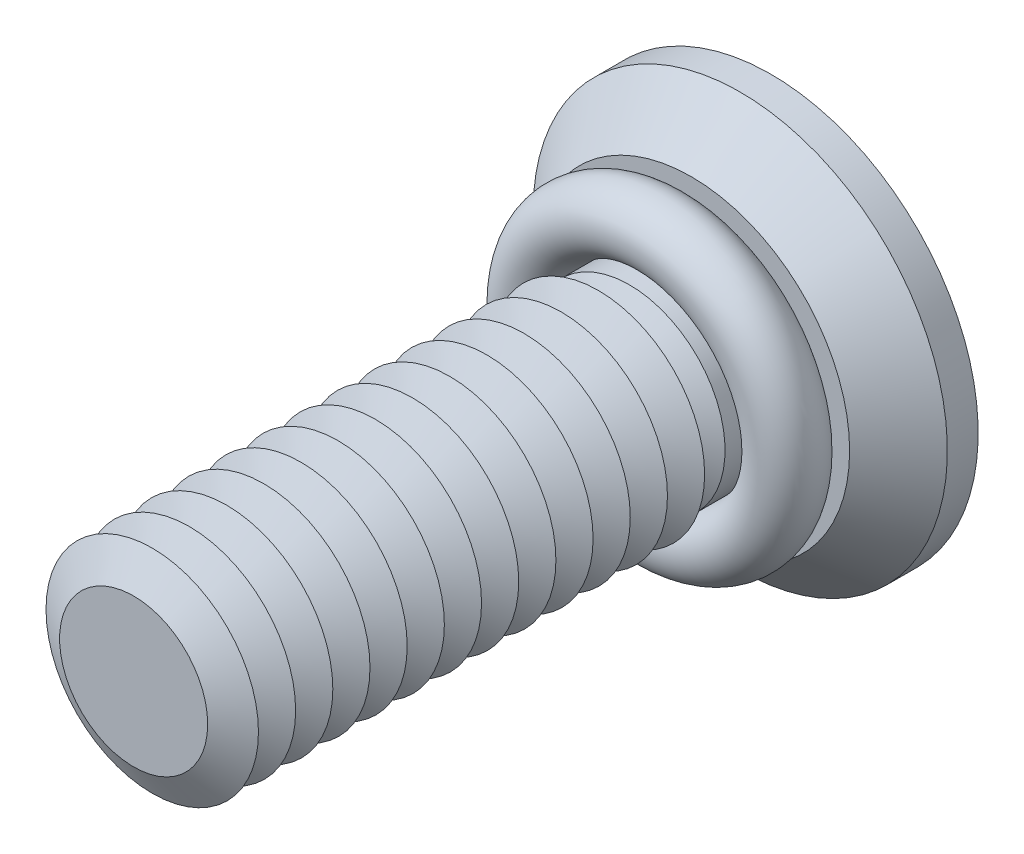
ISO-10303-21;
HEADER;
FILE_DESCRIPTION(('STEP AP214'),'2;1');
FILE_NAME('part.step','',(''),(''),'','','');
FILE_SCHEMA(('AUTOMOTIVE_DESIGN { 1 0 10303 214 1 1 1 1 }'));
ENDSEC;
DATA;
#1=APPLICATION_CONTEXT('core data for automotive mechanical design processes');
#2=APPLICATION_PROTOCOL_DEFINITION('international standard','automotive_design',2000,#1);
#3=PRODUCT_CONTEXT('',#1,'mechanical');
#4=PRODUCT('Part','Part','',(#3));
#5=PRODUCT_RELATED_PRODUCT_CATEGORY('part','',(#4));
#6=PRODUCT_DEFINITION_FORMATION('','',#4);
#7=PRODUCT_DEFINITION_CONTEXT('part definition',#1,'design');
#8=PRODUCT_DEFINITION('design','',#6,#7);
#9=PRODUCT_DEFINITION_SHAPE('','',#8);
#10=(LENGTH_UNIT() NAMED_UNIT(*) SI_UNIT(.MILLI.,.METRE.));
#11=(NAMED_UNIT(*) PLANE_ANGLE_UNIT() SI_UNIT($,.RADIAN.));
#12=(NAMED_UNIT(*) SI_UNIT($,.STERADIAN.) SOLID_ANGLE_UNIT());
#13=UNCERTAINTY_MEASURE_WITH_UNIT(LENGTH_MEASURE(1.E-05),#10,'distance_accuracy_value','');
#14=(GEOMETRIC_REPRESENTATION_CONTEXT(3) GLOBAL_UNCERTAINTY_ASSIGNED_CONTEXT((#13)) GLOBAL_UNIT_ASSIGNED_CONTEXT((#10,
#11,#12)) REPRESENTATION_CONTEXT('',''));
#15=CARTESIAN_POINT('',(0.,0.,0.));
#16=DIRECTION('',(0.,0.,1.));
#17=DIRECTION('',(1.,0.,0.));
#18=AXIS2_PLACEMENT_3D('',#15,#16,#17);
#19=CARTESIAN_POINT('',(0.,0.,2.1));
#20=DIRECTION('',(0.,0.,1.));
#21=DIRECTION('',(1.,0.,0.));
#22=AXIS2_PLACEMENT_3D('',#19,#20,#21);
#23=TOROIDAL_SURFACE('',#22,2.4,0.6);
#24=CARTESIAN_POINT('',(0.,2.4,2.1));
#25=DIRECTION('',(1.,0.,0.));
#26=DIRECTION('',(0.,0.,-1.));
#27=AXIS2_PLACEMENT_3D('',#24,#25,#26);
#28=CIRCLE('',#27,0.6);
#29=CARTESIAN_POINT('',(0.,3.,2.1));
#30=VERTEX_POINT('',#29);
#31=EDGE_CURVE('P0_E10',#30,#30,#28,.T.);
#32=CARTESIAN_POINT('',(0.,0.,2.1));
#33=DIRECTION('',(0.,0.,1.));
#34=DIRECTION('',(1.,0.,0.));
#35=AXIS2_PLACEMENT_3D('',#32,#33,#34);
#36=CIRCLE('',#35,3.);
#37=EDGE_CURVE('',#30,#30,#36,.T.);
#38=ORIENTED_EDGE('',*,*,#31,.F.);
#39=ORIENTED_EDGE('',*,*,#31,.T.);
#40=ORIENTED_EDGE('',*,*,#37,.T.);
#41=ORIENTED_EDGE('',*,*,#37,.F.);
#42=EDGE_LOOP('',(#38,#40,#39,#41));
#43=FACE_BOUND('',#42,.T.);
#44=ADVANCED_FACE('P0_F14',(#43),#23,.T.);
#45=CLOSED_SHELL('',(#44));
#46=MANIFOLD_SOLID_BREP('P0_B1',#45);
#47=CARTESIAN_POINT('',(0.,0.,8.5));
#48=DIRECTION('',(0.,0.,-1.));
#49=DIRECTION('',(-1.,0.,0.));
#50=AXIS2_PLACEMENT_3D('',#47,#48,#49);
#51=CONICAL_SURFACE('',#50,1.39378221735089,1.0471975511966);
#52=CARTESIAN_POINT('',(0.,0.,8.15));
#53=DIRECTION('',(0.,0.,1.));
#54=DIRECTION('',(1.,0.,0.));
#55=AXIS2_PLACEMENT_3D('',#52,#53,#54);
#56=CIRCLE('',#55,2.);
#57=CARTESIAN_POINT('',(2.,0.,8.15));
#58=VERTEX_POINT('',#57);
#59=EDGE_CURVE('P1_E324',#58,#58,#56,.T.);
#60=ORIENTED_EDGE('',*,*,#59,.T.);
#61=EDGE_LOOP('',(#60));
#62=FACE_BOUND('',#61,.T.);
#63=CARTESIAN_POINT('',(0.,0.,8.5));
#64=DIRECTION('',(0.,0.,1.));
#65=DIRECTION('',(1.,0.,0.));
#66=AXIS2_PLACEMENT_3D('',#63,#64,#65);
#67=CIRCLE('',#66,1.39378221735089);
#68=CARTESIAN_POINT('',(1.39378221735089,0.,8.5));
#69=VERTEX_POINT('',#68);
#70=EDGE_CURVE('P1_E321',#69,#69,#67,.T.);
#71=ORIENTED_EDGE('',*,*,#70,.F.);
#72=EDGE_LOOP('',(#71));
#73=FACE_BOUND('',#72,.T.);
#74=ADVANCED_FACE('P1_F15',(#62,#73),#51,.T.);
#75=CARTESIAN_POINT('',(0.,0.,8.85));
#76=DIRECTION('',(0.,0.,1.));
#77=DIRECTION('',(1.,0.,0.));
#78=AXIS2_PLACEMENT_3D('',#75,#76,#77);
#79=CONICAL_SURFACE('',#78,2.,1.0471975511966);
#80=ORIENTED_EDGE('',*,*,#70,.T.);
#81=EDGE_LOOP('',(#80));
#82=FACE_BOUND('',#81,.T.);
#83=CARTESIAN_POINT('',(0.,0.,8.85));
#84=DIRECTION('',(0.,0.,1.));
#85=DIRECTION('',(1.,0.,0.));
#86=AXIS2_PLACEMENT_3D('',#83,#84,#85);
#87=CIRCLE('',#86,2.);
#88=CARTESIAN_POINT('',(2.,0.,8.85));
#89=VERTEX_POINT('',#88);
#90=EDGE_CURVE('P1_E318',#89,#89,#87,.T.);
#91=ORIENTED_EDGE('',*,*,#90,.F.);
#92=EDGE_LOOP('',(#91));
#93=FACE_BOUND('',#92,.T.);
#94=ADVANCED_FACE('P1_F245',(#82,#93),#79,.T.);
#95=CARTESIAN_POINT('',(0.,0.,12.));
#96=DIRECTION('',(0.,0.,1.));
#97=DIRECTION('',(1.,0.,0.));
#98=AXIS2_PLACEMENT_3D('',#95,#96,#97);
#99=PLANE('',#98);
#100=CARTESIAN_POINT('',(0.,0.,12.));
#101=DIRECTION('',(0.,0.,1.));
#102=DIRECTION('',(1.,0.,0.));
#103=AXIS2_PLACEMENT_3D('',#100,#101,#102);
#104=CIRCLE('',#103,1.39378221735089);
#105=CARTESIAN_POINT('',(1.39378221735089,0.,12.));
#106=VERTEX_POINT('',#105);
#107=EDGE_CURVE('P1_E131',#106,#106,#104,.T.);
#108=ORIENTED_EDGE('',*,*,#107,.T.);
#109=EDGE_LOOP('',(#108));
#110=FACE_BOUND('',#109,.T.);
#111=ADVANCED_FACE('P1_F251',(#110),#99,.T.);
#112=CARTESIAN_POINT('',(0.,0.,12.));
#113=DIRECTION('',(0.,0.,-1.));
#114=DIRECTION('',(-1.,0.,0.));
#115=AXIS2_PLACEMENT_3D('',#112,#113,#114);
#116=CONICAL_SURFACE('',#115,1.39378221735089,1.0471975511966);
#117=CARTESIAN_POINT('',(0.,0.,11.65));
#118=DIRECTION('',(0.,0.,1.));
#119=DIRECTION('',(1.,0.,0.));
#120=AXIS2_PLACEMENT_3D('',#117,#118,#119);
#121=CIRCLE('',#120,2.);
#122=CARTESIAN_POINT('',(2.,0.,11.65));
#123=VERTEX_POINT('',#122);
#124=EDGE_CURVE('P1_E133',#123,#123,#121,.T.);
#125=ORIENTED_EDGE('',*,*,#124,.T.);
#126=EDGE_LOOP('',(#125));
#127=FACE_BOUND('',#126,.T.);
#128=ORIENTED_EDGE('',*,*,#107,.F.);
#129=EDGE_LOOP('',(#128));
#130=FACE_BOUND('',#129,.T.);
#131=ADVANCED_FACE('P1_F196',(#127,#130),#116,.T.);
#132=CARTESIAN_POINT('',(0.,0.,11.65));
#133=DIRECTION('',(0.,0.,1.));
#134=DIRECTION('',(1.,0.,0.));
#135=AXIS2_PLACEMENT_3D('',#132,#133,#134);
#136=CONICAL_SURFACE('',#135,2.,1.0471975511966);
#137=CARTESIAN_POINT('',(0.,0.,11.3));
#138=DIRECTION('',(0.,0.,1.));
#139=DIRECTION('',(1.,0.,0.));
#140=AXIS2_PLACEMENT_3D('',#137,#138,#139);
#141=CIRCLE('',#140,1.39378221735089);
#142=CARTESIAN_POINT('',(1.39378221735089,0.,11.3));
#143=VERTEX_POINT('',#142);
#144=EDGE_CURVE('P1_E297',#143,#143,#141,.T.);
#145=ORIENTED_EDGE('',*,*,#144,.T.);
#146=EDGE_LOOP('',(#145));
#147=FACE_BOUND('',#146,.T.);
#148=ORIENTED_EDGE('',*,*,#124,.F.);
#149=EDGE_LOOP('',(#148));
#150=FACE_BOUND('',#149,.T.);
#151=ADVANCED_FACE('P1_F284',(#147,#150),#136,.T.);
#152=CARTESIAN_POINT('',(0.,0.,11.3));
#153=DIRECTION('',(0.,0.,-1.));
#154=DIRECTION('',(-1.,0.,0.));
#155=AXIS2_PLACEMENT_3D('',#152,#153,#154);
#156=CONICAL_SURFACE('',#155,1.39378221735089,1.0471975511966);
#157=CARTESIAN_POINT('',(0.,0.,10.95));
#158=DIRECTION('',(0.,0.,1.));
#159=DIRECTION('',(1.,0.,0.));
#160=AXIS2_PLACEMENT_3D('',#157,#158,#159);
#161=CIRCLE('',#160,2.);
#162=CARTESIAN_POINT('',(2.,0.,10.95));
#163=VERTEX_POINT('',#162);
#164=EDGE_CURVE('P1_E294',#163,#163,#161,.T.);
#165=ORIENTED_EDGE('',*,*,#164,.T.);
#166=EDGE_LOOP('',(#165));
#167=FACE_BOUND('',#166,.T.);
#168=ORIENTED_EDGE('',*,*,#144,.F.);
#169=EDGE_LOOP('',(#168));
#170=FACE_BOUND('',#169,.T.);
#171=ADVANCED_FACE('P1_F279',(#167,#170),#156,.T.);
#172=CARTESIAN_POINT('',(0.,0.,10.95));
#173=DIRECTION('',(0.,0.,1.));
#174=DIRECTION('',(1.,0.,0.));
#175=AXIS2_PLACEMENT_3D('',#172,#173,#174);
#176=CONICAL_SURFACE('',#175,2.,1.0471975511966);
#177=CARTESIAN_POINT('',(0.,0.,10.6));
#178=DIRECTION('',(0.,0.,1.));
#179=DIRECTION('',(1.,0.,0.));
#180=AXIS2_PLACEMENT_3D('',#177,#178,#179);
#181=CIRCLE('',#180,1.39378221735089);
#182=CARTESIAN_POINT('',(1.39378221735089,0.,10.6));
#183=VERTEX_POINT('',#182);
#184=EDGE_CURVE('P1_E301',#183,#183,#181,.T.);
#185=ORIENTED_EDGE('',*,*,#184,.T.);
#186=EDGE_LOOP('',(#185));
#187=FACE_BOUND('',#186,.T.);
#188=ORIENTED_EDGE('',*,*,#164,.F.);
#189=EDGE_LOOP('',(#188));
#190=FACE_BOUND('',#189,.T.);
#191=ADVANCED_FACE('P1_F276',(#187,#190),#176,.T.);
#192=CARTESIAN_POINT('',(0.,0.,10.6));
#193=DIRECTION('',(0.,0.,-1.));
#194=DIRECTION('',(-1.,0.,0.));
#195=AXIS2_PLACEMENT_3D('',#192,#193,#194);
#196=CONICAL_SURFACE('',#195,1.39378221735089,1.0471975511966);
#197=CARTESIAN_POINT('',(0.,0.,10.25));
#198=DIRECTION('',(0.,0.,1.));
#199=DIRECTION('',(1.,0.,0.));
#200=AXIS2_PLACEMENT_3D('',#197,#198,#199);
#201=CIRCLE('',#200,2.);
#202=CARTESIAN_POINT('',(2.,0.,10.25));
#203=VERTEX_POINT('',#202);
#204=EDGE_CURVE('P1_E306',#203,#203,#201,.T.);
#205=ORIENTED_EDGE('',*,*,#204,.T.);
#206=EDGE_LOOP('',(#205));
#207=FACE_BOUND('',#206,.T.);
#208=ORIENTED_EDGE('',*,*,#184,.F.);
#209=EDGE_LOOP('',(#208));
#210=FACE_BOUND('',#209,.T.);
#211=ADVANCED_FACE('P1_F271',(#207,#210),#196,.T.);
#212=CARTESIAN_POINT('',(0.,0.,10.25));
#213=DIRECTION('',(0.,0.,1.));
#214=DIRECTION('',(1.,0.,0.));
#215=AXIS2_PLACEMENT_3D('',#212,#213,#214);
#216=CONICAL_SURFACE('',#215,2.,1.0471975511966);
#217=CARTESIAN_POINT('',(0.,0.,9.9));
#218=DIRECTION('',(0.,0.,1.));
#219=DIRECTION('',(1.,0.,0.));
#220=AXIS2_PLACEMENT_3D('',#217,#218,#219);
#221=CIRCLE('',#220,1.39378221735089);
#222=CARTESIAN_POINT('',(1.39378221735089,0.,9.9));
#223=VERTEX_POINT('',#222);
#224=EDGE_CURVE('P1_E309',#223,#223,#221,.T.);
#225=ORIENTED_EDGE('',*,*,#224,.T.);
#226=EDGE_LOOP('',(#225));
#227=FACE_BOUND('',#226,.T.);
#228=ORIENTED_EDGE('',*,*,#204,.F.);
#229=EDGE_LOOP('',(#228));
#230=FACE_BOUND('',#229,.T.);
#231=ADVANCED_FACE('P1_F268',(#227,#230),#216,.T.);
#232=CARTESIAN_POINT('',(0.,0.,9.9));
#233=DIRECTION('',(0.,0.,-1.));
#234=DIRECTION('',(-1.,0.,0.));
#235=AXIS2_PLACEMENT_3D('',#232,#233,#234);
#236=CONICAL_SURFACE('',#235,1.39378221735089,1.0471975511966);
#237=CARTESIAN_POINT('',(0.,0.,9.55));
#238=DIRECTION('',(0.,0.,1.));
#239=DIRECTION('',(1.,0.,0.));
#240=AXIS2_PLACEMENT_3D('',#237,#238,#239);
#241=CIRCLE('',#240,2.);
#242=CARTESIAN_POINT('',(2.,0.,9.55));
#243=VERTEX_POINT('',#242);
#244=EDGE_CURVE('P1_E312',#243,#243,#241,.T.);
#245=ORIENTED_EDGE('',*,*,#244,.T.);
#246=EDGE_LOOP('',(#245));
#247=FACE_BOUND('',#246,.T.);
#248=ORIENTED_EDGE('',*,*,#224,.F.);
#249=EDGE_LOOP('',(#248));
#250=FACE_BOUND('',#249,.T.);
#251=ADVANCED_FACE('P1_F262',(#247,#250),#236,.T.);
#252=CARTESIAN_POINT('',(0.,0.,9.55));
#253=DIRECTION('',(0.,0.,1.));
#254=DIRECTION('',(1.,0.,0.));
#255=AXIS2_PLACEMENT_3D('',#252,#253,#254);
#256=CONICAL_SURFACE('',#255,2.,1.0471975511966);
#257=CARTESIAN_POINT('',(0.,0.,9.2));
#258=DIRECTION('',(0.,0.,1.));
#259=DIRECTION('',(1.,0.,0.));
#260=AXIS2_PLACEMENT_3D('',#257,#258,#259);
#261=CIRCLE('',#260,1.39378221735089);
#262=CARTESIAN_POINT('',(1.39378221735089,0.,9.2));
#263=VERTEX_POINT('',#262);
#264=EDGE_CURVE('P1_E315',#263,#263,#261,.T.);
#265=ORIENTED_EDGE('',*,*,#264,.T.);
#266=EDGE_LOOP('',(#265));
#267=FACE_BOUND('',#266,.T.);
#268=ORIENTED_EDGE('',*,*,#244,.F.);
#269=EDGE_LOOP('',(#268));
#270=FACE_BOUND('',#269,.T.);
#271=ADVANCED_FACE('P1_F258',(#267,#270),#256,.T.);
#272=CARTESIAN_POINT('',(0.,0.,9.2));
#273=DIRECTION('',(0.,0.,-1.));
#274=DIRECTION('',(-1.,0.,0.));
#275=AXIS2_PLACEMENT_3D('',#272,#273,#274);
#276=CONICAL_SURFACE('',#275,1.39378221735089,1.0471975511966);
#277=ORIENTED_EDGE('',*,*,#90,.T.);
#278=EDGE_LOOP('',(#277));
#279=FACE_BOUND('',#278,.T.);
#280=ORIENTED_EDGE('',*,*,#264,.F.);
#281=EDGE_LOOP('',(#280));
#282=FACE_BOUND('',#281,.T.);
#283=ADVANCED_FACE('P1_F261',(#279,#282),#276,.T.);
#284=CARTESIAN_POINT('',(0.,0.,7.8));
#285=DIRECTION('',(0.,0.,-1.));
#286=DIRECTION('',(-1.,0.,0.));
#287=AXIS2_PLACEMENT_3D('',#284,#285,#286);
#288=CONICAL_SURFACE('',#287,1.39378221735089,1.0471975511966);
#289=CARTESIAN_POINT('',(0.,0.,7.45));
#290=DIRECTION('',(0.,0.,1.));
#291=DIRECTION('',(1.,0.,0.));
#292=AXIS2_PLACEMENT_3D('',#289,#290,#291);
#293=CIRCLE('',#292,2.);
#294=CARTESIAN_POINT('',(2.,0.,7.45));
#295=VERTEX_POINT('',#294);
#296=EDGE_CURVE('P1_E329',#295,#295,#293,.T.);
#297=ORIENTED_EDGE('',*,*,#296,.T.);
#298=EDGE_LOOP('',(#297));
#299=FACE_BOUND('',#298,.T.);
#300=CARTESIAN_POINT('',(0.,0.,7.8));
#301=DIRECTION('',(0.,0.,1.));
#302=DIRECTION('',(1.,0.,0.));
#303=AXIS2_PLACEMENT_3D('',#300,#301,#302);
#304=CIRCLE('',#303,1.39378221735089);
#305=CARTESIAN_POINT('',(1.39378221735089,0.,7.8));
#306=VERTEX_POINT('',#305);
#307=EDGE_CURVE('P1_E326',#306,#306,#304,.T.);
#308=ORIENTED_EDGE('',*,*,#307,.F.);
#309=EDGE_LOOP('',(#308));
#310=FACE_BOUND('',#309,.T.);
#311=ADVANCED_FACE('P1_F266',(#299,#310),#288,.T.);
#312=CARTESIAN_POINT('',(0.,0.,8.15));
#313=DIRECTION('',(0.,0.,1.));
#314=DIRECTION('',(1.,0.,0.));
#315=AXIS2_PLACEMENT_3D('',#312,#313,#314);
#316=CONICAL_SURFACE('',#315,2.,1.0471975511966);
#317=ORIENTED_EDGE('',*,*,#307,.T.);
#318=EDGE_LOOP('',(#317));
#319=FACE_BOUND('',#318,.T.);
#320=ORIENTED_EDGE('',*,*,#59,.F.);
#321=EDGE_LOOP('',(#320));
#322=FACE_BOUND('',#321,.T.);
#323=ADVANCED_FACE('P1_F473',(#319,#322),#316,.T.);
#324=CARTESIAN_POINT('',(0.,0.,7.1));
#325=DIRECTION('',(0.,0.,-1.));
#326=DIRECTION('',(-1.,0.,0.));
#327=AXIS2_PLACEMENT_3D('',#324,#325,#326);
#328=CONICAL_SURFACE('',#327,1.39378221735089,1.0471975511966);
#329=CARTESIAN_POINT('',(0.,0.,6.75));
#330=DIRECTION('',(0.,0.,1.));
#331=DIRECTION('',(1.,0.,0.));
#332=AXIS2_PLACEMENT_3D('',#329,#330,#331);
#333=CIRCLE('',#332,2.);
#334=CARTESIAN_POINT('',(2.,0.,6.75));
#335=VERTEX_POINT('',#334);
#336=EDGE_CURVE('P1_E335',#335,#335,#333,.T.);
#337=ORIENTED_EDGE('',*,*,#336,.T.);
#338=EDGE_LOOP('',(#337));
#339=FACE_BOUND('',#338,.T.);
#340=CARTESIAN_POINT('',(0.,0.,7.1));
#341=DIRECTION('',(0.,0.,1.));
#342=DIRECTION('',(1.,0.,0.));
#343=AXIS2_PLACEMENT_3D('',#340,#341,#342);
#344=CIRCLE('',#343,1.39378221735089);
#345=CARTESIAN_POINT('',(1.39378221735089,0.,7.1));
#346=VERTEX_POINT('',#345);
#347=EDGE_CURVE('P1_E332',#346,#346,#344,.T.);
#348=ORIENTED_EDGE('',*,*,#347,.F.);
#349=EDGE_LOOP('',(#348));
#350=FACE_BOUND('',#349,.T.);
#351=ADVANCED_FACE('P1_F482',(#339,#350),#328,.T.);
#352=CARTESIAN_POINT('',(0.,0.,7.45));
#353=DIRECTION('',(0.,0.,1.));
#354=DIRECTION('',(1.,0.,0.));
#355=AXIS2_PLACEMENT_3D('',#352,#353,#354);
#356=CONICAL_SURFACE('',#355,2.,1.0471975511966);
#357=ORIENTED_EDGE('',*,*,#347,.T.);
#358=EDGE_LOOP('',(#357));
#359=FACE_BOUND('',#358,.T.);
#360=ORIENTED_EDGE('',*,*,#296,.F.);
#361=EDGE_LOOP('',(#360));
#362=FACE_BOUND('',#361,.T.);
#363=ADVANCED_FACE('P1_F492',(#359,#362),#356,.T.);
#364=CARTESIAN_POINT('',(0.,0.,6.4));
#365=DIRECTION('',(0.,0.,-1.));
#366=DIRECTION('',(-1.,0.,0.));
#367=AXIS2_PLACEMENT_3D('',#364,#365,#366);
#368=CONICAL_SURFACE('',#367,1.39378221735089,1.0471975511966);
#369=CARTESIAN_POINT('',(0.,0.,6.05));
#370=DIRECTION('',(0.,0.,1.));
#371=DIRECTION('',(1.,0.,0.));
#372=AXIS2_PLACEMENT_3D('',#369,#370,#371);
#373=CIRCLE('',#372,2.);
#374=CARTESIAN_POINT('',(2.,0.,6.05));
#375=VERTEX_POINT('',#374);
#376=EDGE_CURVE('P1_E341',#375,#375,#373,.T.);
#377=ORIENTED_EDGE('',*,*,#376,.T.);
#378=EDGE_LOOP('',(#377));
#379=FACE_BOUND('',#378,.T.);
#380=CARTESIAN_POINT('',(0.,0.,6.4));
#381=DIRECTION('',(0.,0.,1.));
#382=DIRECTION('',(1.,0.,0.));
#383=AXIS2_PLACEMENT_3D('',#380,#381,#382);
#384=CIRCLE('',#383,1.39378221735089);
#385=CARTESIAN_POINT('',(1.39378221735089,0.,6.4));
#386=VERTEX_POINT('',#385);
#387=EDGE_CURVE('P1_E338',#386,#386,#384,.T.);
#388=ORIENTED_EDGE('',*,*,#387,.F.);
#389=EDGE_LOOP('',(#388));
#390=FACE_BOUND('',#389,.T.);
#391=ADVANCED_FACE('P1_F502',(#379,#390),#368,.T.);
#392=CARTESIAN_POINT('',(0.,0.,6.75));
#393=DIRECTION('',(0.,0.,1.));
#394=DIRECTION('',(1.,0.,0.));
#395=AXIS2_PLACEMENT_3D('',#392,#393,#394);
#396=CONICAL_SURFACE('',#395,2.,1.0471975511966);
#397=ORIENTED_EDGE('',*,*,#387,.T.);
#398=EDGE_LOOP('',(#397));
#399=FACE_BOUND('',#398,.T.);
#400=ORIENTED_EDGE('',*,*,#336,.F.);
#401=EDGE_LOOP('',(#400));
#402=FACE_BOUND('',#401,.T.);
#403=ADVANCED_FACE('P1_F512',(#399,#402),#396,.T.);
#404=CARTESIAN_POINT('',(0.,0.,5.7));
#405=DIRECTION('',(0.,0.,-1.));
#406=DIRECTION('',(-1.,0.,0.));
#407=AXIS2_PLACEMENT_3D('',#404,#405,#406);
#408=CONICAL_SURFACE('',#407,1.39378221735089,1.0471975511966);
#409=CARTESIAN_POINT('',(0.,0.,5.35));
#410=DIRECTION('',(0.,0.,1.));
#411=DIRECTION('',(1.,0.,0.));
#412=AXIS2_PLACEMENT_3D('',#409,#410,#411);
#413=CIRCLE('',#412,2.);
#414=CARTESIAN_POINT('',(2.,0.,5.35));
#415=VERTEX_POINT('',#414);
#416=EDGE_CURVE('P1_E347',#415,#415,#413,.T.);
#417=ORIENTED_EDGE('',*,*,#416,.T.);
#418=EDGE_LOOP('',(#417));
#419=FACE_BOUND('',#418,.T.);
#420=CARTESIAN_POINT('',(0.,0.,5.7));
#421=DIRECTION('',(0.,0.,1.));
#422=DIRECTION('',(1.,0.,0.));
#423=AXIS2_PLACEMENT_3D('',#420,#421,#422);
#424=CIRCLE('',#423,1.39378221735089);
#425=CARTESIAN_POINT('',(1.39378221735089,0.,5.7));
#426=VERTEX_POINT('',#425);
#427=EDGE_CURVE('P1_E344',#426,#426,#424,.T.);
#428=ORIENTED_EDGE('',*,*,#427,.F.);
#429=EDGE_LOOP('',(#428));
#430=FACE_BOUND('',#429,.T.);
#431=ADVANCED_FACE('P1_F522',(#419,#430),#408,.T.);
#432=CARTESIAN_POINT('',(0.,0.,6.05));
#433=DIRECTION('',(0.,0.,1.));
#434=DIRECTION('',(1.,0.,0.));
#435=AXIS2_PLACEMENT_3D('',#432,#433,#434);
#436=CONICAL_SURFACE('',#435,2.,1.0471975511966);
#437=ORIENTED_EDGE('',*,*,#427,.T.);
#438=EDGE_LOOP('',(#437));
#439=FACE_BOUND('',#438,.T.);
#440=ORIENTED_EDGE('',*,*,#376,.F.);
#441=EDGE_LOOP('',(#440));
#442=FACE_BOUND('',#441,.T.);
#443=ADVANCED_FACE('P1_F532',(#439,#442),#436,.T.);
#444=CARTESIAN_POINT('',(0.,0.,5.));
#445=DIRECTION('',(0.,0.,-1.));
#446=DIRECTION('',(-1.,0.,0.));
#447=AXIS2_PLACEMENT_3D('',#444,#445,#446);
#448=CONICAL_SURFACE('',#447,1.39378221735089,1.0471975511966);
#449=CARTESIAN_POINT('',(0.,0.,4.65));
#450=DIRECTION('',(0.,0.,1.));
#451=DIRECTION('',(1.,0.,0.));
#452=AXIS2_PLACEMENT_3D('',#449,#450,#451);
#453=CIRCLE('',#452,2.);
#454=CARTESIAN_POINT('',(2.,0.,4.65));
#455=VERTEX_POINT('',#454);
#456=EDGE_CURVE('P1_E353',#455,#455,#453,.T.);
#457=ORIENTED_EDGE('',*,*,#456,.T.);
#458=EDGE_LOOP('',(#457));
#459=FACE_BOUND('',#458,.T.);
#460=CARTESIAN_POINT('',(0.,0.,5.));
#461=DIRECTION('',(0.,0.,1.));
#462=DIRECTION('',(1.,0.,0.));
#463=AXIS2_PLACEMENT_3D('',#460,#461,#462);
#464=CIRCLE('',#463,1.39378221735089);
#465=CARTESIAN_POINT('',(1.39378221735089,0.,5.));
#466=VERTEX_POINT('',#465);
#467=EDGE_CURVE('P1_E350',#466,#466,#464,.T.);
#468=ORIENTED_EDGE('',*,*,#467,.F.);
#469=EDGE_LOOP('',(#468));
#470=FACE_BOUND('',#469,.T.);
#471=ADVANCED_FACE('P1_F542',(#459,#470),#448,.T.);
#472=CARTESIAN_POINT('',(0.,0.,5.35));
#473=DIRECTION('',(0.,0.,1.));
#474=DIRECTION('',(1.,0.,0.));
#475=AXIS2_PLACEMENT_3D('',#472,#473,#474);
#476=CONICAL_SURFACE('',#475,2.,1.0471975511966);
#477=ORIENTED_EDGE('',*,*,#467,.T.);
#478=EDGE_LOOP('',(#477));
#479=FACE_BOUND('',#478,.T.);
#480=ORIENTED_EDGE('',*,*,#416,.F.);
#481=EDGE_LOOP('',(#480));
#482=FACE_BOUND('',#481,.T.);
#483=ADVANCED_FACE('P1_F552',(#479,#482),#476,.T.);
#484=CARTESIAN_POINT('',(0.,0.,4.3));
#485=DIRECTION('',(0.,0.,-1.));
#486=DIRECTION('',(-1.,0.,0.));
#487=AXIS2_PLACEMENT_3D('',#484,#485,#486);
#488=CONICAL_SURFACE('',#487,1.39378221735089,1.0471975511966);
#489=CARTESIAN_POINT('',(0.,0.,3.95));
#490=DIRECTION('',(0.,0.,1.));
#491=DIRECTION('',(1.,0.,0.));
#492=AXIS2_PLACEMENT_3D('',#489,#490,#491);
#493=CIRCLE('',#492,2.);
#494=CARTESIAN_POINT('',(2.,0.,3.95));
#495=VERTEX_POINT('',#494);
#496=EDGE_CURVE('P1_E359',#495,#495,#493,.T.);
#497=ORIENTED_EDGE('',*,*,#496,.T.);
#498=EDGE_LOOP('',(#497));
#499=FACE_BOUND('',#498,.T.);
#500=CARTESIAN_POINT('',(0.,0.,4.3));
#501=DIRECTION('',(0.,0.,1.));
#502=DIRECTION('',(1.,0.,0.));
#503=AXIS2_PLACEMENT_3D('',#500,#501,#502);
#504=CIRCLE('',#503,1.39378221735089);
#505=CARTESIAN_POINT('',(1.39378221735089,0.,4.3));
#506=VERTEX_POINT('',#505);
#507=EDGE_CURVE('P1_E356',#506,#506,#504,.T.);
#508=ORIENTED_EDGE('',*,*,#507,.F.);
#509=EDGE_LOOP('',(#508));
#510=FACE_BOUND('',#509,.T.);
#511=ADVANCED_FACE('P1_F562',(#499,#510),#488,.T.);
#512=CARTESIAN_POINT('',(0.,0.,4.65));
#513=DIRECTION('',(0.,0.,1.));
#514=DIRECTION('',(1.,0.,0.));
#515=AXIS2_PLACEMENT_3D('',#512,#513,#514);
#516=CONICAL_SURFACE('',#515,2.,1.0471975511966);
#517=ORIENTED_EDGE('',*,*,#507,.T.);
#518=EDGE_LOOP('',(#517));
#519=FACE_BOUND('',#518,.T.);
#520=ORIENTED_EDGE('',*,*,#456,.F.);
#521=EDGE_LOOP('',(#520));
#522=FACE_BOUND('',#521,.T.);
#523=ADVANCED_FACE('P1_F572',(#519,#522),#516,.T.);
#524=CARTESIAN_POINT('',(0.,0.,3.6));
#525=DIRECTION('',(0.,0.,-1.));
#526=DIRECTION('',(-1.,0.,0.));
#527=AXIS2_PLACEMENT_3D('',#524,#525,#526);
#528=CONICAL_SURFACE('',#527,1.39378221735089,1.0471975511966);
#529=CARTESIAN_POINT('',(0.,0.,3.25));
#530=DIRECTION('',(0.,0.,1.));
#531=DIRECTION('',(1.,0.,0.));
#532=AXIS2_PLACEMENT_3D('',#529,#530,#531);
#533=CIRCLE('',#532,2.);
#534=CARTESIAN_POINT('',(2.,0.,3.25));
#535=VERTEX_POINT('',#534);
#536=EDGE_CURVE('P1_E365',#535,#535,#533,.T.);
#537=ORIENTED_EDGE('',*,*,#536,.T.);
#538=EDGE_LOOP('',(#537));
#539=FACE_BOUND('',#538,.T.);
#540=CARTESIAN_POINT('',(0.,0.,3.6));
#541=DIRECTION('',(0.,0.,1.));
#542=DIRECTION('',(1.,0.,0.));
#543=AXIS2_PLACEMENT_3D('',#540,#541,#542);
#544=CIRCLE('',#543,1.39378221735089);
#545=CARTESIAN_POINT('',(1.39378221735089,0.,3.6));
#546=VERTEX_POINT('',#545);
#547=EDGE_CURVE('P1_E362',#546,#546,#544,.T.);
#548=ORIENTED_EDGE('',*,*,#547,.F.);
#549=EDGE_LOOP('',(#548));
#550=FACE_BOUND('',#549,.T.);
#551=ADVANCED_FACE('P1_F582',(#539,#550),#528,.T.);
#552=CARTESIAN_POINT('',(0.,0.,3.95));
#553=DIRECTION('',(0.,0.,1.));
#554=DIRECTION('',(1.,0.,0.));
#555=AXIS2_PLACEMENT_3D('',#552,#553,#554);
#556=CONICAL_SURFACE('',#555,2.,1.0471975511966);
#557=ORIENTED_EDGE('',*,*,#547,.T.);
#558=EDGE_LOOP('',(#557));
#559=FACE_BOUND('',#558,.T.);
#560=ORIENTED_EDGE('',*,*,#496,.F.);
#561=EDGE_LOOP('',(#560));
#562=FACE_BOUND('',#561,.T.);
#563=ADVANCED_FACE('P1_F378',(#559,#562),#556,.T.);
#564=CARTESIAN_POINT('',(0.,0.,2.9));
#565=DIRECTION('',(0.,0.,-1.));
#566=DIRECTION('',(-1.,0.,0.));
#567=AXIS2_PLACEMENT_3D('',#564,#565,#566);
#568=CONICAL_SURFACE('',#567,1.39378221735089,1.0471975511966);
#569=CARTESIAN_POINT('',(0.,0.,2.9));
#570=DIRECTION('',(0.,0.,1.));
#571=DIRECTION('',(1.,0.,0.));
#572=AXIS2_PLACEMENT_3D('',#569,#570,#571);
#573=CIRCLE('',#572,1.39378221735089);
#574=CARTESIAN_POINT('',(1.39378221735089,0.,2.9));
#575=VERTEX_POINT('',#574);
#576=EDGE_CURVE('P1_E368',#575,#575,#573,.T.);
#577=ORIENTED_EDGE('',*,*,#576,.F.);
#578=EDGE_LOOP('',(#577));
#579=FACE_BOUND('',#578,.T.);
#580=CARTESIAN_POINT('',(0.,0.,2.66547005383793));
#581=DIRECTION('',(0.,0.,-1.));
#582=DIRECTION('',(-1.,0.,0.));
#583=AXIS2_PLACEMENT_3D('',#580,#581,#582);
#584=CIRCLE('',#583,1.8);
#585=CARTESIAN_POINT('',(-1.8,0.,2.66547005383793));
#586=VERTEX_POINT('',#585);
#587=EDGE_CURVE('P1_E19',#586,#586,#584,.F.);
#588=ORIENTED_EDGE('',*,*,#587,.T.);
#589=EDGE_LOOP('',(#588));
#590=FACE_BOUND('',#589,.T.);
#591=ADVANCED_FACE('P1_F375',(#579,#590),#568,.T.);
#592=CARTESIAN_POINT('',(0.,0.,3.25));
#593=DIRECTION('',(0.,0.,1.));
#594=DIRECTION('',(1.,0.,0.));
#595=AXIS2_PLACEMENT_3D('',#592,#593,#594);
#596=CONICAL_SURFACE('',#595,2.,1.0471975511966);
#597=ORIENTED_EDGE('',*,*,#576,.T.);
#598=EDGE_LOOP('',(#597));
#599=FACE_BOUND('',#598,.T.);
#600=ORIENTED_EDGE('',*,*,#536,.F.);
#601=EDGE_LOOP('',(#600));
#602=FACE_BOUND('',#601,.T.);
#603=ADVANCED_FACE('P1_F372',(#599,#602),#596,.T.);
#604=CARTESIAN_POINT('',(0.,0.,1.5));
#605=DIRECTION('',(0.,0.,-1.));
#606=DIRECTION('',(-1.,0.,0.));
#607=AXIS2_PLACEMENT_3D('',#604,#605,#606);
#608=CONICAL_SURFACE('',#607,1.25,1.0471975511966);
#609=CARTESIAN_POINT('',(0.,0.,2.22168783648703));
#610=VERTEX_POINT('',#609);
#611=VERTEX_LOOP('',#610);
#612=FACE_BOUND('',#611,.T.);
#613=CARTESIAN_POINT('',(0.,0.,1.5));
#614=DIRECTION('',(0.,0.,-1.));
#615=DIRECTION('',(-1.,0.,0.));
#616=AXIS2_PLACEMENT_3D('',#613,#614,#615);
#617=CIRCLE('',#616,1.25);
#618=CARTESIAN_POINT('',(-1.25,0.,1.5));
#619=VERTEX_POINT('',#618);
#620=CARTESIAN_POINT('',(-0.625,1.08253175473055,1.5));
#621=VERTEX_POINT('',#620);
#622=EDGE_CURVE('P1_E117',#619,#621,#617,.T.);
#623=ORIENTED_EDGE('',*,*,#622,.T.);
#624=CARTESIAN_POINT('',(0.,0.,1.5));
#625=DIRECTION('',(0.,0.,-1.));
#626=DIRECTION('',(-1.,0.,0.));
#627=AXIS2_PLACEMENT_3D('',#624,#625,#626);
#628=CIRCLE('',#627,1.25);
#629=CARTESIAN_POINT('',(0.625,1.08253175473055,1.5));
#630=VERTEX_POINT('',#629);
#631=EDGE_CURVE('P1_E24',#621,#630,#628,.T.);
#632=ORIENTED_EDGE('',*,*,#631,.T.);
#633=CARTESIAN_POINT('',(1.25,0.,1.5));
#634=VERTEX_POINT('',#633);
#635=EDGE_CURVE('P1_E817',#630,#634,#628,.T.);
#636=ORIENTED_EDGE('',*,*,#635,.T.);
#637=CARTESIAN_POINT('',(0.625,-1.08253175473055,1.5));
#638=VERTEX_POINT('',#637);
#639=EDGE_CURVE('P1_E810',#634,#638,#628,.T.);
#640=ORIENTED_EDGE('',*,*,#639,.T.);
#641=CARTESIAN_POINT('',(-0.625,-1.08253175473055,1.5));
#642=VERTEX_POINT('',#641);
#643=EDGE_CURVE('P1_E182',#638,#642,#628,.T.);
#644=ORIENTED_EDGE('',*,*,#643,.T.);
#645=EDGE_CURVE('P1_E179',#642,#619,#628,.T.);
#646=ORIENTED_EDGE('',*,*,#645,.T.);
#647=EDGE_LOOP('',(#623,#632,#636,#640,#644,#646));
#648=FACE_BOUND('',#647,.T.);
#649=ADVANCED_FACE('P1_F198',(#612,#648),#608,.F.);
#650=CARTESIAN_POINT('',(0.,0.,1.5));
#651=DIRECTION('',(0.,0.,-1.));
#652=DIRECTION('',(-1.,0.,0.));
#653=AXIS2_PLACEMENT_3D('',#650,#651,#652);
#654=PLANE('',#653);
#655=ORIENTED_EDGE('',*,*,#643,.F.);
#656=DIRECTION('',(-0.866025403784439,-0.5,0.));
#657=VECTOR('',#656,1.);
#658=CARTESIAN_POINT('',(1.25,-0.721687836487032,1.5));
#659=LINE('',#658,#657);
#660=CARTESIAN_POINT('',(0.,-1.44337567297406,1.5));
#661=VERTEX_POINT('',#660);
#662=EDGE_CURVE('P1_E826',#638,#661,#659,.T.);
#663=ORIENTED_EDGE('',*,*,#662,.T.);
#664=DIRECTION('',(-0.866025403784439,0.5,0.));
#665=VECTOR('',#664,1.);
#666=CARTESIAN_POINT('',(0.,-1.44337567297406,1.5));
#667=LINE('',#666,#665);
#668=EDGE_CURVE('P1_E833',#661,#642,#667,.T.);
#669=ORIENTED_EDGE('',*,*,#668,.T.);
#670=EDGE_LOOP('',(#655,#663,#669));
#671=FACE_BOUND('',#670,.T.);
#672=ADVANCED_FACE('P1_F625',(#671),#654,.T.);
#673=ORIENTED_EDGE('',*,*,#645,.F.);
#674=CARTESIAN_POINT('',(-1.25,-0.721687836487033,1.5));
#675=VERTEX_POINT('',#674);
#676=EDGE_CURVE('P1_E836',#642,#675,#667,.T.);
#677=ORIENTED_EDGE('',*,*,#676,.T.);
#678=DIRECTION('',(0.,1.,0.));
#679=VECTOR('',#678,1.);
#680=CARTESIAN_POINT('',(-1.25,-0.721687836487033,1.5));
#681=LINE('',#680,#679);
#682=EDGE_CURVE('P1_E123',#675,#619,#681,.T.);
#683=ORIENTED_EDGE('',*,*,#682,.T.);
#684=EDGE_LOOP('',(#673,#677,#683));
#685=FACE_BOUND('',#684,.T.);
#686=ADVANCED_FACE('P1_F231',(#685),#654,.T.);
#687=ORIENTED_EDGE('',*,*,#622,.F.);
#688=CARTESIAN_POINT('',(-1.25,0.721687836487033,1.5));
#689=VERTEX_POINT('',#688);
#690=EDGE_CURVE('P1_E838',#619,#689,#681,.T.);
#691=ORIENTED_EDGE('',*,*,#690,.T.);
#692=DIRECTION('',(0.866025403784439,0.5,0.));
#693=VECTOR('',#692,1.);
#694=CARTESIAN_POINT('',(-1.25,0.721687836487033,1.5));
#695=LINE('',#694,#693);
#696=EDGE_CURVE('P1_E841',#689,#621,#695,.T.);
#697=ORIENTED_EDGE('',*,*,#696,.T.);
#698=EDGE_LOOP('',(#687,#691,#697));
#699=FACE_BOUND('',#698,.T.);
#700=ADVANCED_FACE('P1_F642',(#699),#654,.T.);
#701=ORIENTED_EDGE('',*,*,#631,.F.);
#702=CARTESIAN_POINT('',(0.,1.44337567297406,1.5));
#703=VERTEX_POINT('',#702);
#704=EDGE_CURVE('P1_E840',#621,#703,#695,.T.);
#705=ORIENTED_EDGE('',*,*,#704,.T.);
#706=DIRECTION('',(0.866025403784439,-0.5,0.));
#707=VECTOR('',#706,1.);
#708=CARTESIAN_POINT('',(0.,1.44337567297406,1.5));
#709=LINE('',#708,#707);
#710=EDGE_CURVE('P1_E161',#703,#630,#709,.T.);
#711=ORIENTED_EDGE('',*,*,#710,.T.);
#712=EDGE_LOOP('',(#701,#705,#711));
#713=FACE_BOUND('',#712,.T.);
#714=ADVANCED_FACE('P1_F651',(#713),#654,.T.);
#715=ORIENTED_EDGE('',*,*,#635,.F.);
#716=CARTESIAN_POINT('',(1.25,0.721687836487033,1.5));
#717=VERTEX_POINT('',#716);
#718=EDGE_CURVE('P1_E825',#630,#717,#709,.T.);
#719=ORIENTED_EDGE('',*,*,#718,.T.);
#720=DIRECTION('',(0.,-1.,0.));
#721=VECTOR('',#720,1.);
#722=CARTESIAN_POINT('',(1.25,0.721687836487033,1.5));
#723=LINE('',#722,#721);
#724=EDGE_CURVE('P1_E820',#717,#634,#723,.T.);
#725=ORIENTED_EDGE('',*,*,#724,.T.);
#726=EDGE_LOOP('',(#715,#719,#725));
#727=FACE_BOUND('',#726,.T.);
#728=ADVANCED_FACE('P1_F660',(#727),#654,.T.);
#729=ORIENTED_EDGE('',*,*,#639,.F.);
#730=CARTESIAN_POINT('',(1.25,-0.721687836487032,1.5));
#731=VERTEX_POINT('',#730);
#732=EDGE_CURVE('P1_E812',#634,#731,#723,.T.);
#733=ORIENTED_EDGE('',*,*,#732,.T.);
#734=EDGE_CURVE('P1_E125',#731,#638,#659,.T.);
#735=ORIENTED_EDGE('',*,*,#734,.T.);
#736=EDGE_LOOP('',(#729,#733,#735));
#737=FACE_BOUND('',#736,.T.);
#738=ADVANCED_FACE('P1_F229',(#737),#654,.T.);
#739=CARTESIAN_POINT('',(1.25,-0.721687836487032,1.5));
#740=DIRECTION('',(0.5,-0.866025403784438,0.));
#741=DIRECTION('',(0.866025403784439,0.5,0.));
#742=AXIS2_PLACEMENT_3D('',#739,#740,#741);
#743=PLANE('',#742);
#744=DIRECTION('',(0.,0.,-1.));
#745=VECTOR('',#744,1.);
#746=CARTESIAN_POINT('',(1.25,-0.721687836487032,1.5));
#747=LINE('',#746,#745);
#748=CARTESIAN_POINT('',(1.25,-0.721687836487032,0.));
#749=VERTEX_POINT('',#748);
#750=EDGE_CURVE('P1_E164',#731,#749,#747,.T.);
#751=ORIENTED_EDGE('',*,*,#750,.T.);
#752=CARTESIAN_POINT('',(1.2502,-0.721572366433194,-3.09438201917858E-05));
#753=CARTESIAN_POINT('',(1.19827409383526,-0.75155180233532,0.00800698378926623));
#754=CARTESIAN_POINT('',(1.14625401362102,-0.781585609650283,0.0153042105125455));
#755=CARTESIAN_POINT('',(1.04203006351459,-0.841759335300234,0.028124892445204));
#756=CARTESIAN_POINT('',(0.989826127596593,-0.871899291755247,0.0336476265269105));
#757=CARTESIAN_POINT('',(0.88555111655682,-0.932102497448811,0.0425967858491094));
#758=CARTESIAN_POINT('',(0.833480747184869,-0.96216533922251,0.0460338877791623));
#759=CARTESIAN_POINT('',(0.729273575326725,-1.0223293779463,0.0506427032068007));
#760=CARTESIAN_POINT('',(0.677136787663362,-1.05243056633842,0.0518148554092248));
#761=CARTESIAN_POINT('',(0.572863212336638,-1.11263294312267,0.0518148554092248));
#762=CARTESIAN_POINT('',(0.520726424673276,-1.1427341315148,0.0506427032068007));
#763=CARTESIAN_POINT('',(0.416519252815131,-1.20289817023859,0.0460338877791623));
#764=CARTESIAN_POINT('',(0.36444888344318,-1.23296101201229,0.0425967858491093));
#765=CARTESIAN_POINT('',(0.260173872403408,-1.29316421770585,0.0336476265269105));
#766=CARTESIAN_POINT('',(0.207969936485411,-1.32330417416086,0.028124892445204));
#767=CARTESIAN_POINT('',(0.103745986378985,-1.38347789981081,0.0153042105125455));
#768=CARTESIAN_POINT('',(0.0517259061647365,-1.41351170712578,0.00800698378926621));
#769=CARTESIAN_POINT('',(-0.000199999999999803,-1.4434911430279,-3.09438201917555E-05));
#770=B_SPLINE_CURVE_WITH_KNOTS('',3,(#752,#753,#754,#755,#756,#757,#758,#759,#760,#761,#762,
#763,#764,#765,#766,#767,#768,#769),.UNSPECIFIED.,.F.,.F.,(4,2,2,2,2,2,2,2,4),(0.,
0.18149525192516,0.363064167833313,0.543695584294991,0.724292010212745,0.904888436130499,
1.08551985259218,1.26708876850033,1.44858402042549),.UNSPECIFIED.);
#771=CARTESIAN_POINT('',(0.,-1.44337567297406,0.));
#772=VERTEX_POINT('',#771);
#773=EDGE_CURVE('P1_E118',#749,#772,#770,.T.);
#774=ORIENTED_EDGE('',*,*,#773,.T.);
#775=DIRECTION('',(0.,0.,-1.));
#776=VECTOR('',#775,1.);
#777=CARTESIAN_POINT('',(0.,-1.44337567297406,1.5));
#778=LINE('',#777,#776);
#779=EDGE_CURVE('P1_E116',#661,#772,#778,.T.);
#780=ORIENTED_EDGE('',*,*,#779,.F.);
#781=ORIENTED_EDGE('',*,*,#662,.F.);
#782=ORIENTED_EDGE('',*,*,#734,.F.);
#783=EDGE_LOOP('',(#751,#774,#780,#781,#782));
#784=FACE_BOUND('',#783,.T.);
#785=ADVANCED_FACE('P1_F226',(#784),#743,.F.);
#786=CARTESIAN_POINT('',(0.,-1.44337567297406,1.5));
#787=DIRECTION('',(-0.5,-0.866025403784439,0.));
#788=DIRECTION('',(0.866025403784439,-0.5,0.));
#789=AXIS2_PLACEMENT_3D('',#786,#787,#788);
#790=PLANE('',#789);
#791=ORIENTED_EDGE('',*,*,#779,.T.);
#792=CARTESIAN_POINT('',(0.000200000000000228,-1.4434911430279,-3.094382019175E-05));
#793=CARTESIAN_POINT('',(-0.0517259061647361,-1.41351170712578,0.00800698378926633));
#794=CARTESIAN_POINT('',(-0.103745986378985,-1.38347789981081,0.0153042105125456));
#795=CARTESIAN_POINT('',(-0.207969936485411,-1.32330417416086,0.028124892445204));
#796=CARTESIAN_POINT('',(-0.260173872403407,-1.29316421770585,0.0336476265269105));
#797=CARTESIAN_POINT('',(-0.36444888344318,-1.23296101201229,0.0425967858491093));
#798=CARTESIAN_POINT('',(-0.416519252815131,-1.20289817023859,0.0460338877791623));
#799=CARTESIAN_POINT('',(-0.520726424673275,-1.1427341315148,0.0506427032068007));
#800=CARTESIAN_POINT('',(-0.572863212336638,-1.11263294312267,0.0518148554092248));
#801=CARTESIAN_POINT('',(-0.677136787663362,-1.05243056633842,0.0518148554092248));
#802=CARTESIAN_POINT('',(-0.729273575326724,-1.0223293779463,0.0506427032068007));
#803=CARTESIAN_POINT('',(-0.833480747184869,-0.96216533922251,0.0460338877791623));
#804=CARTESIAN_POINT('',(-0.88555111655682,-0.932102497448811,0.0425967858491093));
#805=CARTESIAN_POINT('',(-0.989826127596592,-0.871899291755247,0.0336476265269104));
#806=CARTESIAN_POINT('',(-1.04203006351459,-0.841759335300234,0.028124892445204));
#807=CARTESIAN_POINT('',(-1.14625401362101,-0.781585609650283,0.0153042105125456));
#808=CARTESIAN_POINT('',(-1.19827409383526,-0.751551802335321,0.00800698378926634));
#809=CARTESIAN_POINT('',(-1.2502,-0.721572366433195,-3.09438201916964E-05));
#810=B_SPLINE_CURVE_WITH_KNOTS('',3,(#792,#793,#794,#795,#796,#797,#798,#799,#800,#801,#802,
#803,#804,#805,#806,#807,#808,#809),.UNSPECIFIED.,.F.,.F.,(4,2,2,2,2,2,2,2,4),(0.,
0.18149525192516,0.363064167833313,0.543695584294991,0.724292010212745,0.904888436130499,
1.08551985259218,1.26708876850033,1.44858402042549),.UNSPECIFIED.);
#811=CARTESIAN_POINT('',(-1.25,-0.721687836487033,0.));
#812=VERTEX_POINT('',#811);
#813=EDGE_CURVE('P1_E94',#772,#812,#810,.T.);
#814=ORIENTED_EDGE('',*,*,#813,.T.);
#815=DIRECTION('',(0.,0.,-1.));
#816=VECTOR('',#815,1.);
#817=CARTESIAN_POINT('',(-1.25,-0.721687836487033,1.5));
#818=LINE('',#817,#816);
#819=EDGE_CURVE('P1_E112',#675,#812,#818,.T.);
#820=ORIENTED_EDGE('',*,*,#819,.F.);
#821=ORIENTED_EDGE('',*,*,#676,.F.);
#822=ORIENTED_EDGE('',*,*,#668,.F.);
#823=EDGE_LOOP('',(#791,#814,#820,#821,#822));
#824=FACE_BOUND('',#823,.T.);
#825=ADVANCED_FACE('P1_F110',(#824),#790,.F.);
#826=CARTESIAN_POINT('',(-1.25,-0.721687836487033,1.5));
#827=DIRECTION('',(-1.,0.,0.));
#828=DIRECTION('',(0.,0.,1.));
#829=AXIS2_PLACEMENT_3D('',#826,#827,#828);
#830=PLANE('',#829);
#831=ORIENTED_EDGE('',*,*,#819,.T.);
#832=CARTESIAN_POINT('',(-1.25,-1.88400474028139,-0.219073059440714));
#833=CARTESIAN_POINT('',(-1.25,-1.82756112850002,-0.206472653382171));
#834=CARTESIAN_POINT('',(-1.25,-1.77108164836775,-0.194032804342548));
#835=CARTESIAN_POINT('',(-1.25,-1.65803301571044,-0.169555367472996));
#836=CARTESIAN_POINT('',(-1.25,-1.60146385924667,-0.157517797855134));
#837=CARTESIAN_POINT('',(-1.25,-1.43148763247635,-0.122107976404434));
#838=CARTESIAN_POINT('',(-1.25,-1.31792638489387,-0.0994645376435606));
#839=CARTESIAN_POINT('',(-1.25,-1.09123200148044,-0.057323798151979));
#840=CARTESIAN_POINT('',(-1.25,-0.978103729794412,-0.0378008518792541));
#841=CARTESIAN_POINT('',(-1.25,-0.751170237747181,-0.00320860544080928));
#842=CARTESIAN_POINT('',(-1.25,-0.637365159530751,0.0118615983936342));
#843=CARTESIAN_POINT('',(-1.25,-0.407744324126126,0.0355899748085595));
#844=CARTESIAN_POINT('',(-1.25,-0.291920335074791,0.0441742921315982));
#845=CARTESIAN_POINT('',(-1.25,-0.117976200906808,0.0506819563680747));
#846=CARTESIAN_POINT('',(-1.25,-0.059969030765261,0.0517900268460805));
#847=CARTESIAN_POINT('',(-1.25,0.0560463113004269,0.051838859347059));
#848=CARTESIAN_POINT('',(-1.25,0.114054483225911,0.0507796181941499));
#849=CARTESIAN_POINT('',(-1.25,0.288428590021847,0.0443978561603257));
#850=CARTESIAN_POINT('',(-1.25,0.404683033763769,0.0358543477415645));
#851=CARTESIAN_POINT('',(-1.25,0.63652474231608,0.0119999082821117));
#852=CARTESIAN_POINT('',(-1.25,0.752111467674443,-0.00331588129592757));
#853=CARTESIAN_POINT('',(-1.25,0.98558577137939,-0.0389793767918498));
#854=CARTESIAN_POINT('',(-1.25,1.10345418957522,-0.0594485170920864));
#855=CARTESIAN_POINT('',(-1.25,1.3386179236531,-0.10348104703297));
#856=CARTESIAN_POINT('',(-1.25,1.45591314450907,-0.127044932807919));
#857=CARTESIAN_POINT('',(-1.25,1.69011362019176,-0.176177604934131));
#858=CARTESIAN_POINT('',(-1.25,1.80701875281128,-0.201746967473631));
#859=CARTESIAN_POINT('',(-1.25,2.04053091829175,-0.254214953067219));
#860=CARTESIAN_POINT('',(-1.25,2.15713794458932,-0.281113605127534));
#861=CARTESIAN_POINT('',(-1.25,2.38871499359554,-0.335489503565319));
#862=CARTESIAN_POINT('',(-1.25,2.50368762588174,-0.362955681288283));
#863=CARTESIAN_POINT('',(-1.25,2.73348169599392,-0.418523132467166));
#864=CARTESIAN_POINT('',(-1.25,2.84830313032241,-0.446624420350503));
#865=CARTESIAN_POINT('',(-1.25,3.07767157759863,-0.503250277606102));
#866=CARTESIAN_POINT('',(-1.25,3.19221874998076,-0.531774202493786));
#867=CARTESIAN_POINT('',(-1.25,3.4212203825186,-0.589174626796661));
#868=CARTESIAN_POINT('',(-1.25,3.53567484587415,-0.618051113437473));
#869=CARTESIAN_POINT('',(-1.25,3.65009781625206,-0.647050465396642));
#870=B_SPLINE_CURVE_WITH_KNOTS('',3,(#832,#833,#834,#835,#836,#837,#838,#839,#840,#841,#842,
#843,#844,#845,#846,#847,#848,#849,#850,#851,#852,#853,#854,#855,#856,#857,#858,#859,#860,#861,
#862,#863,#864,#865,#866,#867,#868,#869),.UNSPECIFIED.,.F.,.F.,(4,2,2,2,2,2,2,2,2,2,2,2,2,2,2,2,
2,2,4),(0.,0.173498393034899,0.347004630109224,0.694369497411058,1.03871380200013,
1.38298817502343,1.73112607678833,1.90514173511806,2.07915764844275,2.42857002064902,
2.77823347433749,3.13706733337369,3.49595878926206,3.8549537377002,4.21395652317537,
4.56857767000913,4.92320688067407,5.27734186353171,5.63146405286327),.UNSPECIFIED.);
#871=CARTESIAN_POINT('',(-1.25,0.721687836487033,0.));
#872=VERTEX_POINT('',#871);
#873=EDGE_CURVE('P1_E10',#812,#872,#870,.T.);
#874=ORIENTED_EDGE('',*,*,#873,.T.);
#875=DIRECTION('',(0.,0.,-1.));
#876=VECTOR('',#875,1.);
#877=CARTESIAN_POINT('',(-1.25,0.721687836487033,1.5));
#878=LINE('',#877,#876);
#879=EDGE_CURVE('P1_E124',#689,#872,#878,.T.);
#880=ORIENTED_EDGE('',*,*,#879,.F.);
#881=ORIENTED_EDGE('',*,*,#690,.F.);
#882=ORIENTED_EDGE('',*,*,#682,.F.);
#883=EDGE_LOOP('',(#831,#874,#880,#881,#882));
#884=FACE_BOUND('',#883,.T.);
#885=ADVANCED_FACE('P1_F120',(#884),#830,.F.);
#886=CARTESIAN_POINT('',(-1.25,0.721687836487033,1.5));
#887=DIRECTION('',(-0.5,0.866025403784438,0.));
#888=DIRECTION('',(-0.866025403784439,-0.5,0.));
#889=AXIS2_PLACEMENT_3D('',#886,#887,#888);
#890=PLANE('',#889);
#891=ORIENTED_EDGE('',*,*,#879,.T.);
#892=CARTESIAN_POINT('',(-1.2502,0.721572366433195,-3.09438201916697E-05));
#893=CARTESIAN_POINT('',(-1.19827409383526,0.75155180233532,0.00800698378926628));
#894=CARTESIAN_POINT('',(-1.14625401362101,0.781585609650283,0.0153042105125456));
#895=CARTESIAN_POINT('',(-1.04203006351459,0.841759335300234,0.028124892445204));
#896=CARTESIAN_POINT('',(-0.989826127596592,0.871899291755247,0.0336476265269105));
#897=CARTESIAN_POINT('',(-0.88555111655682,0.932102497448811,0.0425967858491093));
#898=CARTESIAN_POINT('',(-0.833480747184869,0.96216533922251,0.0460338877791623));
#899=CARTESIAN_POINT('',(-0.729273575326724,1.0223293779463,0.0506427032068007));
#900=CARTESIAN_POINT('',(-0.677136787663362,1.05243056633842,0.0518148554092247));
#901=CARTESIAN_POINT('',(-0.572863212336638,1.11263294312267,0.0518148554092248));
#902=CARTESIAN_POINT('',(-0.520726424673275,1.1427341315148,0.0506427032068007));
#903=CARTESIAN_POINT('',(-0.416519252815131,1.20289817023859,0.0460338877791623));
#904=CARTESIAN_POINT('',(-0.36444888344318,1.23296101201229,0.0425967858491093));
#905=CARTESIAN_POINT('',(-0.260173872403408,1.29316421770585,0.0336476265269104));
#906=CARTESIAN_POINT('',(-0.207969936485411,1.32330417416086,0.0281248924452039));
#907=CARTESIAN_POINT('',(-0.103745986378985,1.38347789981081,0.0153042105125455));
#908=CARTESIAN_POINT('',(-0.0517259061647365,1.41351170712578,0.00800698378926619));
#909=CARTESIAN_POINT('',(0.000199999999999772,1.4434911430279,-3.09438201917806E-05));
#910=B_SPLINE_CURVE_WITH_KNOTS('',3,(#892,#893,#894,#895,#896,#897,#898,#899,#900,#901,#902,
#903,#904,#905,#906,#907,#908,#909),.UNSPECIFIED.,.F.,.F.,(4,2,2,2,2,2,2,2,4),(0.,
0.18149525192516,0.363064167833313,0.543695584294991,0.724292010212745,0.904888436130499,
1.08551985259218,1.26708876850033,1.44858402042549),.UNSPECIFIED.);
#911=CARTESIAN_POINT('',(0.,1.44337567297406,0.));
#912=VERTEX_POINT('',#911);
#913=EDGE_CURVE('P1_E136',#872,#912,#910,.T.);
#914=ORIENTED_EDGE('',*,*,#913,.T.);
#915=DIRECTION('',(0.,0.,-1.));
#916=VECTOR('',#915,1.);
#917=CARTESIAN_POINT('',(0.,1.44337567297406,1.5));
#918=LINE('',#917,#916);
#919=EDGE_CURVE('P1_E155',#703,#912,#918,.T.);
#920=ORIENTED_EDGE('',*,*,#919,.F.);
#921=ORIENTED_EDGE('',*,*,#704,.F.);
#922=ORIENTED_EDGE('',*,*,#696,.F.);
#923=EDGE_LOOP('',(#891,#914,#920,#921,#922));
#924=FACE_BOUND('',#923,.T.);
#925=ADVANCED_FACE('P1_F153',(#924),#890,.F.);
#926=CARTESIAN_POINT('',(0.,1.44337567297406,1.5));
#927=DIRECTION('',(0.5,0.866025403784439,0.));
#928=DIRECTION('',(-0.866025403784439,0.5,0.));
#929=AXIS2_PLACEMENT_3D('',#926,#927,#928);
#930=PLANE('',#929);
#931=ORIENTED_EDGE('',*,*,#919,.T.);
#932=CARTESIAN_POINT('',(-0.000200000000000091,1.4434911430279,-3.09438201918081E-05));
#933=CARTESIAN_POINT('',(0.0517259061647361,1.41351170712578,0.00800698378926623));
#934=CARTESIAN_POINT('',(0.103745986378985,1.38347789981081,0.0153042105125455));
#935=CARTESIAN_POINT('',(0.207969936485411,1.32330417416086,0.0281248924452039));
#936=CARTESIAN_POINT('',(0.260173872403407,1.29316421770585,0.0336476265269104));
#937=CARTESIAN_POINT('',(0.36444888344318,1.23296101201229,0.0425967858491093));
#938=CARTESIAN_POINT('',(0.416519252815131,1.20289817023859,0.0460338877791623));
#939=CARTESIAN_POINT('',(0.520726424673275,1.1427341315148,0.0506427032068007));
#940=CARTESIAN_POINT('',(0.572863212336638,1.11263294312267,0.0518148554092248));
#941=CARTESIAN_POINT('',(0.677136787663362,1.05243056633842,0.0518148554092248));
#942=CARTESIAN_POINT('',(0.729273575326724,1.0223293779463,0.0506427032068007));
#943=CARTESIAN_POINT('',(0.833480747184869,0.96216533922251,0.0460338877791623));
#944=CARTESIAN_POINT('',(0.88555111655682,0.932102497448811,0.0425967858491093));
#945=CARTESIAN_POINT('',(0.989826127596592,0.871899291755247,0.0336476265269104));
#946=CARTESIAN_POINT('',(1.04203006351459,0.841759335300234,0.028124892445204));
#947=CARTESIAN_POINT('',(1.14625401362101,0.781585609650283,0.0153042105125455));
#948=CARTESIAN_POINT('',(1.19827409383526,0.75155180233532,0.00800698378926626));
#949=CARTESIAN_POINT('',(1.2502,0.721572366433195,-3.09438201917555E-05));
#950=B_SPLINE_CURVE_WITH_KNOTS('',3,(#932,#933,#934,#935,#936,#937,#938,#939,#940,#941,#942,
#943,#944,#945,#946,#947,#948,#949),.UNSPECIFIED.,.F.,.F.,(4,2,2,2,2,2,2,2,4),(0.,
0.18149525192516,0.363064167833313,0.543695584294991,0.724292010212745,0.904888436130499,
1.08551985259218,1.26708876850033,1.44858402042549),.UNSPECIFIED.);
#951=CARTESIAN_POINT('',(1.25,0.721687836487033,0.));
#952=VERTEX_POINT('',#951);
#953=EDGE_CURVE('P1_E141',#912,#952,#950,.T.);
#954=ORIENTED_EDGE('',*,*,#953,.T.);
#955=DIRECTION('',(0.,0.,-1.));
#956=VECTOR('',#955,1.);
#957=CARTESIAN_POINT('',(1.25,0.721687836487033,1.5));
#958=LINE('',#957,#956);
#959=EDGE_CURVE('P1_E162',#717,#952,#958,.T.);
#960=ORIENTED_EDGE('',*,*,#959,.F.);
#961=ORIENTED_EDGE('',*,*,#718,.F.);
#962=ORIENTED_EDGE('',*,*,#710,.F.);
#963=EDGE_LOOP('',(#931,#954,#960,#961,#962));
#964=FACE_BOUND('',#963,.T.);
#965=ADVANCED_FACE('P1_F158',(#964),#930,.F.);
#966=CARTESIAN_POINT('',(1.25,0.721687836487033,1.5));
#967=DIRECTION('',(1.,0.,0.));
#968=DIRECTION('',(0.,0.,-1.));
#969=AXIS2_PLACEMENT_3D('',#966,#967,#968);
#970=PLANE('',#969);
#971=ORIENTED_EDGE('',*,*,#959,.T.);
#972=CARTESIAN_POINT('',(1.25,-1.88400474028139,-0.219073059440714));
#973=CARTESIAN_POINT('',(1.25,-1.82756112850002,-0.206472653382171));
#974=CARTESIAN_POINT('',(1.25,-1.77108164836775,-0.194032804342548));
#975=CARTESIAN_POINT('',(1.25,-1.65803301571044,-0.169555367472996));
#976=CARTESIAN_POINT('',(1.25,-1.60146385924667,-0.157517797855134));
#977=CARTESIAN_POINT('',(1.25,-1.43148763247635,-0.122107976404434));
#978=CARTESIAN_POINT('',(1.25,-1.31792638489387,-0.0994645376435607));
#979=CARTESIAN_POINT('',(1.25,-1.09123200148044,-0.0573237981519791));
#980=CARTESIAN_POINT('',(1.25,-0.978103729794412,-0.0378008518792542));
#981=CARTESIAN_POINT('',(1.25,-0.751170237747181,-0.00320860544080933));
#982=CARTESIAN_POINT('',(1.25,-0.63736515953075,0.0118615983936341));
#983=CARTESIAN_POINT('',(1.25,-0.407744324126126,0.0355899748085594));
#984=CARTESIAN_POINT('',(1.25,-0.29192033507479,0.0441742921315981));
#985=CARTESIAN_POINT('',(1.25,-0.117976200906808,0.0506819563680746));
#986=CARTESIAN_POINT('',(1.25,-0.0599690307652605,0.0517900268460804));
#987=CARTESIAN_POINT('',(1.25,0.0560463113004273,0.0518388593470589));
#988=CARTESIAN_POINT('',(1.25,0.114054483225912,0.0507796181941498));
#989=CARTESIAN_POINT('',(1.25,0.288428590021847,0.0443978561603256));
#990=CARTESIAN_POINT('',(1.25,0.40468303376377,0.0358543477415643));
#991=CARTESIAN_POINT('',(1.25,0.636524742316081,0.0119999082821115));
#992=CARTESIAN_POINT('',(1.25,0.752111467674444,-0.00331588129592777));
#993=CARTESIAN_POINT('',(1.25,0.985585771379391,-0.03897937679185));
#994=CARTESIAN_POINT('',(1.25,1.10345418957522,-0.0594485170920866));
#995=CARTESIAN_POINT('',(1.25,1.3386179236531,-0.103481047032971));
#996=CARTESIAN_POINT('',(1.25,1.45591314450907,-0.127044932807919));
#997=CARTESIAN_POINT('',(1.25,1.69011362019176,-0.176177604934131));
#998=CARTESIAN_POINT('',(1.25,1.80701875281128,-0.201746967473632));
#999=CARTESIAN_POINT('',(1.25,2.04053091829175,-0.254214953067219));
#1000=CARTESIAN_POINT('',(1.25,2.15713794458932,-0.281113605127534));
#1001=CARTESIAN_POINT('',(1.25,2.38871499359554,-0.335489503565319));
#1002=CARTESIAN_POINT('',(1.25,2.50368762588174,-0.362955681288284));
#1003=CARTESIAN_POINT('',(1.25,2.73348169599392,-0.418523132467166));
#1004=CARTESIAN_POINT('',(1.25,2.84830313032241,-0.446624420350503));
#1005=CARTESIAN_POINT('',(1.25,3.07767157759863,-0.503250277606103));
#1006=CARTESIAN_POINT('',(1.25,3.19221874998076,-0.531774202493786));
#1007=CARTESIAN_POINT('',(1.25,3.4212203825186,-0.589174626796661));
#1008=CARTESIAN_POINT('',(1.25,3.53567484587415,-0.618051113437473));
#1009=CARTESIAN_POINT('',(1.25,3.65009781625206,-0.647050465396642));
#1010=B_SPLINE_CURVE_WITH_KNOTS('',3,(#972,#973,#974,#975,#976,#977,#978,#979,#980,#981,#982,
#983,#984,#985,#986,#987,#988,#989,#990,#991,#992,#993,#994,#995,#996,#997,#998,#999,#1000,
#1001,#1002,#1003,#1004,#1005,#1006,#1007,#1008,#1009),.UNSPECIFIED.,.F.,.F.,(4,2,2,2,2,2,2,2,2,
2,2,2,2,2,2,2,2,2,4),(0.,0.173498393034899,0.347004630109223,0.694369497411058,1.03871380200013,
1.38298817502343,1.73112607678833,1.90514173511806,2.07915764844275,2.42857002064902,
2.77823347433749,3.13706733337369,3.49595878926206,3.8549537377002,4.21395652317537,
4.56857767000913,4.92320688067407,5.27734186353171,5.63146405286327),.UNSPECIFIED.);
#1011=EDGE_CURVE('P1_E149',#952,#749,#1010,.F.);
#1012=ORIENTED_EDGE('',*,*,#1011,.T.);
#1013=ORIENTED_EDGE('',*,*,#750,.F.);
#1014=ORIENTED_EDGE('',*,*,#732,.F.);
#1015=ORIENTED_EDGE('',*,*,#724,.F.);
#1016=EDGE_LOOP('',(#971,#1012,#1013,#1014,#1015));
#1017=FACE_BOUND('',#1016,.T.);
#1018=ADVANCED_FACE('P1_F232',(#1017),#970,.F.);
#1019=CARTESIAN_POINT('',(0.,0.,0.));
#1020=DIRECTION('',(0.,0.,-1.));
#1021=DIRECTION('',(-1.,0.,0.));
#1022=AXIS2_PLACEMENT_3D('',#1019,#1020,#1021);
#1023=CONICAL_SURFACE('',#1022,1.44337567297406,1.30899693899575);
#1024=CARTESIAN_POINT('',(0.,0.,0.));
#1025=DIRECTION('',(0.,0.,-1.));
#1026=DIRECTION('',(-1.,0.,0.));
#1027=AXIS2_PLACEMENT_3D('',#1024,#1025,#1026);
#1028=CIRCLE('',#1027,1.44337567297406);
#1029=EDGE_CURVE('P1_E30',#749,#772,#1028,.T.);
#1030=ORIENTED_EDGE('',*,*,#1029,.T.);
#1031=ORIENTED_EDGE('',*,*,#773,.F.);
#1032=EDGE_LOOP('',(#1030,#1031));
#1033=FACE_BOUND('',#1032,.T.);
#1034=ADVANCED_FACE('P1_F195',(#1033),#1023,.F.);
#1035=EDGE_CURVE('P1_E90',#772,#812,#1028,.T.);
#1036=ORIENTED_EDGE('',*,*,#1035,.T.);
#1037=ORIENTED_EDGE('',*,*,#813,.F.);
#1038=EDGE_LOOP('',(#1036,#1037));
#1039=FACE_BOUND('',#1038,.T.);
#1040=ADVANCED_FACE('P1_F92',(#1039),#1023,.F.);
#1041=EDGE_CURVE('P1_E98',#812,#872,#1028,.T.);
#1042=ORIENTED_EDGE('',*,*,#1041,.T.);
#1043=ORIENTED_EDGE('',*,*,#873,.F.);
#1044=EDGE_LOOP('',(#1042,#1043));
#1045=FACE_BOUND('',#1044,.T.);
#1046=ADVANCED_FACE('P1_F102',(#1045),#1023,.F.);
#1047=EDGE_CURVE('P1_E130',#872,#912,#1028,.T.);
#1048=ORIENTED_EDGE('',*,*,#1047,.T.);
#1049=ORIENTED_EDGE('',*,*,#913,.F.);
#1050=EDGE_LOOP('',(#1048,#1049));
#1051=FACE_BOUND('',#1050,.T.);
#1052=ADVANCED_FACE('P1_F734',(#1051),#1023,.F.);
#1053=EDGE_CURVE('P1_E137',#912,#952,#1028,.T.);
#1054=ORIENTED_EDGE('',*,*,#1053,.T.);
#1055=ORIENTED_EDGE('',*,*,#953,.F.);
#1056=EDGE_LOOP('',(#1054,#1055));
#1057=FACE_BOUND('',#1056,.T.);
#1058=ADVANCED_FACE('P1_F144',(#1057),#1023,.F.);
#1059=EDGE_CURVE('P1_E37',#952,#749,#1028,.T.);
#1060=ORIENTED_EDGE('',*,*,#1059,.T.);
#1061=ORIENTED_EDGE('',*,*,#1011,.F.);
#1062=EDGE_LOOP('',(#1060,#1061));
#1063=FACE_BOUND('',#1062,.T.);
#1064=ADVANCED_FACE('P1_F721',(#1063),#1023,.F.);
#1065=CARTESIAN_POINT('',(0.,0.,0.));
#1066=DIRECTION('',(0.,0.,1.));
#1067=DIRECTION('',(1.,0.,0.));
#1068=AXIS2_PLACEMENT_3D('',#1065,#1066,#1067);
#1069=PLANE('',#1068);
#1070=ORIENTED_EDGE('',*,*,#1059,.F.);
#1071=ORIENTED_EDGE('',*,*,#1053,.F.);
#1072=ORIENTED_EDGE('',*,*,#1047,.F.);
#1073=ORIENTED_EDGE('',*,*,#1041,.F.);
#1074=ORIENTED_EDGE('',*,*,#1035,.F.);
#1075=ORIENTED_EDGE('',*,*,#1029,.F.);
#1076=EDGE_LOOP('',(#1070,#1071,#1072,#1073,#1074,#1075));
#1077=FACE_BOUND('',#1076,.T.);
#1078=CARTESIAN_POINT('',(0.,0.,0.));
#1079=DIRECTION('',(0.,0.,-1.));
#1080=DIRECTION('',(-1.,0.,0.));
#1081=AXIS2_PLACEMENT_3D('',#1078,#1079,#1080);
#1082=CIRCLE('',#1081,3.9);
#1083=CARTESIAN_POINT('',(-3.9,0.,0.));
#1084=VERTEX_POINT('',#1083);
#1085=EDGE_CURVE('P1_E169',#1084,#1084,#1082,.T.);
#1086=ORIENTED_EDGE('',*,*,#1085,.T.);
#1087=EDGE_LOOP('',(#1086));
#1088=FACE_BOUND('',#1087,.T.);
#1089=ADVANCED_FACE('P1_F17',(#1077,#1088),#1069,.F.);
#1090=CARTESIAN_POINT('',(0.,0.,12.));
#1091=DIRECTION('',(0.,0.,-1.));
#1092=DIRECTION('',(-1.,0.,0.));
#1093=AXIS2_PLACEMENT_3D('',#1090,#1091,#1092);
#1094=CYLINDRICAL_SURFACE('',#1093,3.9);
#1095=ORIENTED_EDGE('',*,*,#1085,.F.);
#1096=EDGE_LOOP('',(#1095));
#1097=FACE_BOUND('',#1096,.T.);
#1098=CARTESIAN_POINT('',(0.,0.,0.580000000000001));
#1099=DIRECTION('',(0.,0.,-1.));
#1100=DIRECTION('',(-1.,0.,0.));
#1101=AXIS2_PLACEMENT_3D('',#1098,#1099,#1100);
#1102=CIRCLE('',#1101,3.9);
#1103=CARTESIAN_POINT('',(-3.9,0.,0.580000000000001));
#1104=VERTEX_POINT('',#1103);
#1105=EDGE_CURVE('P1_E172',#1104,#1104,#1102,.T.);
#1106=ORIENTED_EDGE('',*,*,#1105,.T.);
#1107=EDGE_LOOP('',(#1106));
#1108=FACE_BOUND('',#1107,.T.);
#1109=ADVANCED_FACE('P1_F396',(#1097,#1108),#1094,.T.);
#1110=CARTESIAN_POINT('',(0.,0.,0.));
#1111=DIRECTION('',(0.,0.,-1.));
#1112=DIRECTION('',(-1.,0.,0.));
#1113=AXIS2_PLACEMENT_3D('',#1110,#1111,#1112);
#1114=CONICAL_SURFACE('',#1113,4.48,0.785398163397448);
#1115=CARTESIAN_POINT('',(0.,0.,1.5));
#1116=DIRECTION('',(0.,0.,-1.));
#1117=DIRECTION('',(-1.,0.,0.));
#1118=AXIS2_PLACEMENT_3D('',#1115,#1116,#1117);
#1119=CIRCLE('',#1118,2.98);
#1120=CARTESIAN_POINT('',(-2.98,0.,1.5));
#1121=VERTEX_POINT('',#1120);
#1122=EDGE_CURVE('P1_E176',#1121,#1121,#1119,.T.);
#1123=ORIENTED_EDGE('',*,*,#1122,.T.);
#1124=EDGE_LOOP('',(#1123));
#1125=FACE_BOUND('',#1124,.T.);
#1126=ORIENTED_EDGE('',*,*,#1105,.F.);
#1127=EDGE_LOOP('',(#1126));
#1128=FACE_BOUND('',#1127,.T.);
#1129=ADVANCED_FACE('P1_F391',(#1125,#1128),#1114,.T.);
#1130=CARTESIAN_POINT('',(0.,1.8,1.5));
#1131=DIRECTION('',(0.,0.,-1.));
#1132=DIRECTION('',(-1.,0.,0.));
#1133=AXIS2_PLACEMENT_3D('',#1130,#1131,#1132);
#1134=PLANE('',#1133);
#1135=CARTESIAN_POINT('',(0.,0.,1.5));
#1136=DIRECTION('',(0.,0.,-1.));
#1137=DIRECTION('',(-1.,0.,0.));
#1138=AXIS2_PLACEMENT_3D('',#1135,#1136,#1137);
#1139=CIRCLE('',#1138,1.8);
#1140=CARTESIAN_POINT('',(-1.8,0.,1.5));
#1141=VERTEX_POINT('',#1140);
#1142=EDGE_CURVE('P1_E173',#1141,#1141,#1139,.T.);
#1143=ORIENTED_EDGE('',*,*,#1142,.T.);
#1144=EDGE_LOOP('',(#1143));
#1145=FACE_BOUND('',#1144,.T.);
#1146=ORIENTED_EDGE('',*,*,#1122,.F.);
#1147=EDGE_LOOP('',(#1146));
#1148=FACE_BOUND('',#1147,.T.);
#1149=ADVANCED_FACE('P1_F385',(#1145,#1148),#1134,.F.);
#1150=CARTESIAN_POINT('',(0.,0.,0.));
#1151=DIRECTION('',(0.,0.,-1.));
#1152=DIRECTION('',(-1.,0.,0.));
#1153=AXIS2_PLACEMENT_3D('',#1150,#1151,#1152);
#1154=CYLINDRICAL_SURFACE('',#1153,1.8);
#1155=ORIENTED_EDGE('',*,*,#1142,.F.);
#1156=EDGE_LOOP('',(#1155));
#1157=FACE_BOUND('',#1156,.T.);
#1158=ORIENTED_EDGE('',*,*,#587,.F.);
#1159=EDGE_LOOP('',(#1158));
#1160=FACE_BOUND('',#1159,.T.);
#1161=ADVANCED_FACE('P1_F383',(#1157,#1160),#1154,.T.);
#1162=CLOSED_SHELL('',(#74,#94,#111,#131,#151,#171,#191,#211,#231,#251,#271,#283,#311,#323,#351,
#363,#391,#403,#431,#443,#471,#483,#511,#523,#551,#563,#591,#603,#649,#672,#686,#700,#714,#728,
#738,#785,#825,#885,#925,#965,#1018,#1034,#1040,#1046,#1052,#1058,#1064,#1089,#1109,#1129,#1149,#1161));
#1163=MANIFOLD_SOLID_BREP('P1_B1',#1162);
#1164=ADVANCED_BREP_SHAPE_REPRESENTATION('',(#18,#46,#1163),#14);
#1165=SHAPE_DEFINITION_REPRESENTATION(#9,#1164);
ENDSEC;
END-ISO-10303-21;
